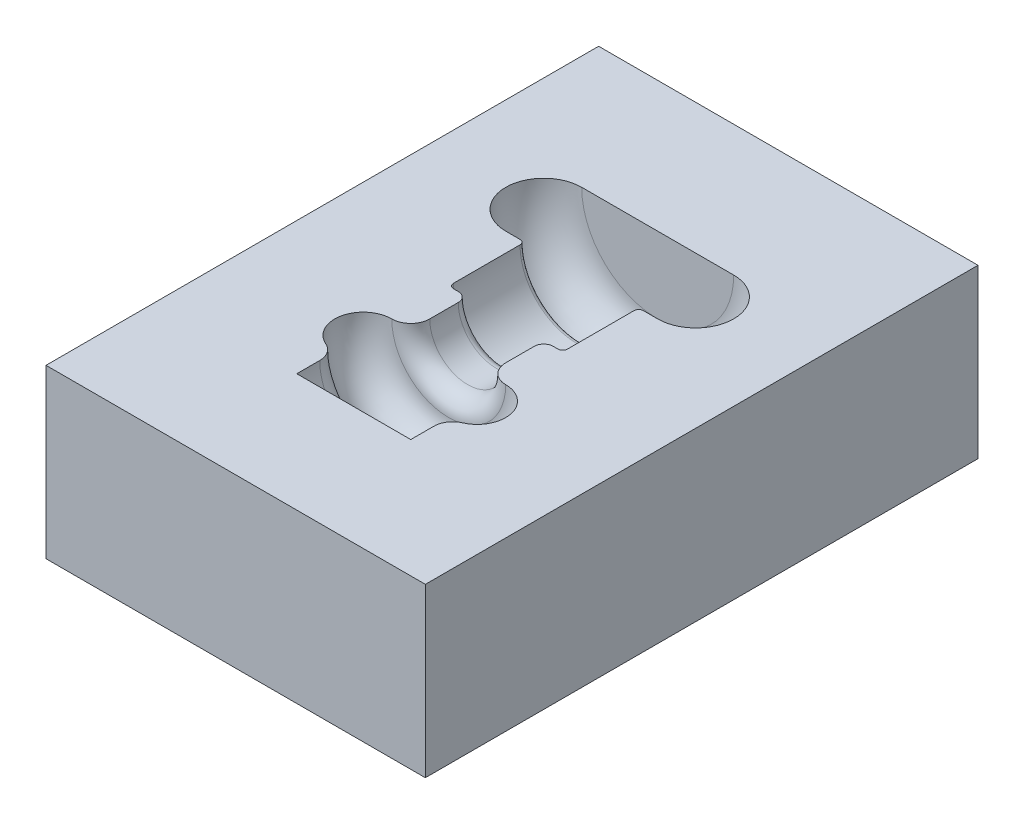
ISO-10303-21;
HEADER;
FILE_DESCRIPTION(('STEP AP214'),'2;1');
FILE_NAME('part.step','',(''),(''),'','','');
FILE_SCHEMA(('AUTOMOTIVE_DESIGN { 1 0 10303 214 1 1 1 1 }'));
ENDSEC;
DATA;
#1=APPLICATION_CONTEXT('core data for automotive mechanical design processes');
#2=APPLICATION_PROTOCOL_DEFINITION('international standard','automotive_design',2000,#1);
#3=PRODUCT_CONTEXT('',#1,'mechanical');
#4=PRODUCT('Part','Part','',(#3));
#5=PRODUCT_RELATED_PRODUCT_CATEGORY('part','',(#4));
#6=PRODUCT_DEFINITION_FORMATION('','',#4);
#7=PRODUCT_DEFINITION_CONTEXT('part definition',#1,'design');
#8=PRODUCT_DEFINITION('design','',#6,#7);
#9=PRODUCT_DEFINITION_SHAPE('','',#8);
#10=(LENGTH_UNIT() NAMED_UNIT(*) SI_UNIT(.MILLI.,.METRE.));
#11=(NAMED_UNIT(*) PLANE_ANGLE_UNIT() SI_UNIT($,.RADIAN.));
#12=(NAMED_UNIT(*) SI_UNIT($,.STERADIAN.) SOLID_ANGLE_UNIT());
#13=UNCERTAINTY_MEASURE_WITH_UNIT(LENGTH_MEASURE(1.E-05),#10,'distance_accuracy_value','');
#14=(GEOMETRIC_REPRESENTATION_CONTEXT(3) GLOBAL_UNCERTAINTY_ASSIGNED_CONTEXT((#13)) GLOBAL_UNIT_ASSIGNED_CONTEXT((#10,
#11,#12)) REPRESENTATION_CONTEXT('',''));
#15=CARTESIAN_POINT('',(0.,0.,0.));
#16=DIRECTION('',(0.,0.,1.));
#17=DIRECTION('',(1.,0.,0.));
#18=AXIS2_PLACEMENT_3D('',#15,#16,#17);
#19=CARTESIAN_POINT('',(-102.966766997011,0.,-153.41));
#20=DIRECTION('',(0.,-1.,0.));
#21=DIRECTION('',(1.,0.,0.));
#22=AXIS2_PLACEMENT_3D('',#19,#20,#21);
#23=PLANE('',#22);
#24=DIRECTION('',(0.,0.,1.));
#25=VECTOR('',#24,1.);
#26=CARTESIAN_POINT('',(-30.9366,0.,82.4976));
#27=LINE('',#26,#25);
#28=CARTESIAN_POINT('',(-30.9366,0.,70.0331185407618));
#29=VERTEX_POINT('',#28);
#30=CARTESIAN_POINT('',(-30.9366,0.,82.4976));
#31=VERTEX_POINT('',#30);
#32=EDGE_CURVE('E237',#29,#31,#27,.T.);
#33=ORIENTED_EDGE('',*,*,#32,.F.);
#34=CARTESIAN_POINT('',(-41.2488,0.,70.0331185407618));
#35=DIRECTION('',(0.,-1.,0.));
#36=DIRECTION('',(1.,0.,0.));
#37=AXIS2_PLACEMENT_3D('',#34,#35,#36);
#38=CIRCLE('',#37,10.3122);
#39=CARTESIAN_POINT('',(-37.12392,0.,60.5818311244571));
#40=VERTEX_POINT('',#39);
#41=EDGE_CURVE('E233',#29,#40,#38,.F.);
#42=ORIENTED_EDGE('',*,*,#41,.T.);
#43=CARTESIAN_POINT('',(-30.9366,0.,46.4049));
#44=DIRECTION('',(0.,-1.,0.));
#45=DIRECTION('',(1.,0.,0.));
#46=AXIS2_PLACEMENT_3D('',#43,#44,#45);
#47=CIRCLE('',#46,15.4683);
#48=CARTESIAN_POINT('',(-30.9366,0.,30.9366));
#49=VERTEX_POINT('',#48);
#50=EDGE_CURVE('E227',#49,#40,#47,.F.);
#51=ORIENTED_EDGE('',*,*,#50,.F.);
#52=CARTESIAN_POINT('',(-30.9366,0.,20.6244));
#53=DIRECTION('',(0.,-1.,0.));
#54=DIRECTION('',(1.,0.,0.));
#55=AXIS2_PLACEMENT_3D('',#52,#53,#54);
#56=CIRCLE('',#55,10.3122);
#57=CARTESIAN_POINT('',(-20.6244,0.,20.6244));
#58=VERTEX_POINT('',#57);
#59=EDGE_CURVE('E223',#49,#58,#56,.F.);
#60=ORIENTED_EDGE('',*,*,#59,.T.);
#61=DIRECTION('',(0.,0.,1.));
#62=VECTOR('',#61,1.);
#63=CARTESIAN_POINT('',(-20.6244,0.,82.4976));
#64=LINE('',#63,#62);
#65=CARTESIAN_POINT('',(-20.6244,0.,5.1561));
#66=VERTEX_POINT('',#65);
#67=EDGE_CURVE('E217',#66,#58,#64,.T.);
#68=ORIENTED_EDGE('',*,*,#67,.F.);
#69=CARTESIAN_POINT('',(-25.7805,0.,5.15609999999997));
#70=DIRECTION('',(0.,-1.,0.));
#71=DIRECTION('',(1.,0.,0.));
#72=AXIS2_PLACEMENT_3D('',#69,#70,#71);
#73=CIRCLE('',#72,5.1561);
#74=CARTESIAN_POINT('',(-25.7805,0.,0.));
#75=VERTEX_POINT('',#74);
#76=EDGE_CURVE('E207',#66,#75,#73,.F.);
#77=ORIENTED_EDGE('',*,*,#76,.T.);
#78=DIRECTION('',(1.,0.,0.));
#79=VECTOR('',#78,1.);
#80=CARTESIAN_POINT('',(0.,0.,0.));
#81=LINE('',#80,#79);
#82=CARTESIAN_POINT('',(-28.35855,0.,0.));
#83=VERTEX_POINT('',#82);
#84=EDGE_CURVE('E215',#83,#75,#81,.T.);
#85=ORIENTED_EDGE('',*,*,#84,.F.);
#86=CARTESIAN_POINT('',(-28.35855,0.,-2.57805000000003));
#87=DIRECTION('',(0.,-1.,0.));
#88=DIRECTION('',(1.,0.,0.));
#89=AXIS2_PLACEMENT_3D('',#86,#87,#88);
#90=CIRCLE('',#89,2.57805);
#91=CARTESIAN_POINT('',(-30.9366,0.,-2.57805000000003));
#92=VERTEX_POINT('',#91);
#93=EDGE_CURVE('E210',#92,#83,#90,.F.);
#94=ORIENTED_EDGE('',*,*,#93,.F.);
#95=DIRECTION('',(0.,0.,1.));
#96=VECTOR('',#95,1.);
#97=CARTESIAN_POINT('',(-30.9366,0.,82.4976));
#98=LINE('',#97,#96);
#99=CARTESIAN_POINT('',(-30.9366,0.,-38.67075));
#100=VERTEX_POINT('',#99);
#101=EDGE_CURVE('E204',#100,#92,#98,.T.);
#102=ORIENTED_EDGE('',*,*,#101,.F.);
#103=CARTESIAN_POINT('',(-33.51465,0.,-38.67075));
#104=DIRECTION('',(0.,-1.,0.));
#105=DIRECTION('',(1.,0.,0.));
#106=AXIS2_PLACEMENT_3D('',#103,#104,#105);
#107=CIRCLE('',#106,2.57805);
#108=CARTESIAN_POINT('',(-33.51465,0.,-41.2488));
#109=VERTEX_POINT('',#108);
#110=EDGE_CURVE('E11',#100,#109,#107,.F.);
#111=ORIENTED_EDGE('',*,*,#110,.T.);
#112=DIRECTION('',(1.,0.,0.));
#113=VECTOR('',#112,1.);
#114=CARTESIAN_POINT('',(0.,0.,-41.2488));
#115=LINE('',#114,#113);
#116=CARTESIAN_POINT('',(-41.2488,0.,-41.2488));
#117=VERTEX_POINT('',#116);
#118=EDGE_CURVE('E203',#117,#109,#115,.T.);
#119=ORIENTED_EDGE('',*,*,#118,.F.);
#120=CARTESIAN_POINT('',(-41.2488,0.,-61.8732));
#121=DIRECTION('',(0.,-1.,0.));
#122=DIRECTION('',(1.,0.,0.));
#123=AXIS2_PLACEMENT_3D('',#120,#121,#122);
#124=CIRCLE('',#123,20.6244);
#125=CARTESIAN_POINT('',(-41.2488,0.,-82.4976));
#126=VERTEX_POINT('',#125);
#127=EDGE_CURVE('E192',#126,#117,#124,.F.);
#128=ORIENTED_EDGE('',*,*,#127,.F.);
#129=DIRECTION('',(-1.,0.,0.));
#130=VECTOR('',#129,1.);
#131=CARTESIAN_POINT('',(0.,0.,-82.4976));
#132=LINE('',#131,#130);
#133=CARTESIAN_POINT('',(41.2488,0.,-82.4976));
#134=VERTEX_POINT('',#133);
#135=EDGE_CURVE('E174',#134,#126,#132,.T.);
#136=ORIENTED_EDGE('',*,*,#135,.F.);
#137=CARTESIAN_POINT('',(41.2488,0.,-61.8732));
#138=DIRECTION('',(0.,-1.,0.));
#139=DIRECTION('',(1.,0.,0.));
#140=AXIS2_PLACEMENT_3D('',#137,#138,#139);
#141=CIRCLE('',#140,20.6244);
#142=CARTESIAN_POINT('',(41.2488,0.,-41.2488));
#143=VERTEX_POINT('',#142);
#144=EDGE_CURVE('E200',#143,#134,#141,.F.);
#145=ORIENTED_EDGE('',*,*,#144,.F.);
#146=CARTESIAN_POINT('',(33.51465,0.,-41.2488));
#147=VERTEX_POINT('',#146);
#148=EDGE_CURVE('E202',#147,#143,#115,.T.);
#149=ORIENTED_EDGE('',*,*,#148,.F.);
#150=CARTESIAN_POINT('',(33.51465,0.,-38.67075));
#151=DIRECTION('',(0.,-1.,0.));
#152=DIRECTION('',(1.,0.,0.));
#153=AXIS2_PLACEMENT_3D('',#150,#151,#152);
#154=CIRCLE('',#153,2.57805);
#155=CARTESIAN_POINT('',(30.9366,0.,-38.67075));
#156=VERTEX_POINT('',#155);
#157=EDGE_CURVE('E40',#147,#156,#154,.F.);
#158=ORIENTED_EDGE('',*,*,#157,.T.);
#159=DIRECTION('',(0.,0.,1.));
#160=VECTOR('',#159,1.);
#161=CARTESIAN_POINT('',(30.9366,0.,82.4976));
#162=LINE('',#161,#160);
#163=CARTESIAN_POINT('',(30.9366,0.,-2.57805000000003));
#164=VERTEX_POINT('',#163);
#165=EDGE_CURVE('E48',#164,#156,#162,.F.);
#166=ORIENTED_EDGE('',*,*,#165,.F.);
#167=CARTESIAN_POINT('',(28.35855,0.,-2.57805000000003));
#168=DIRECTION('',(0.,-1.,0.));
#169=DIRECTION('',(1.,0.,0.));
#170=AXIS2_PLACEMENT_3D('',#167,#168,#169);
#171=CIRCLE('',#170,2.57805);
#172=CARTESIAN_POINT('',(28.35855,0.,0.));
#173=VERTEX_POINT('',#172);
#174=EDGE_CURVE('E212',#173,#164,#171,.F.);
#175=ORIENTED_EDGE('',*,*,#174,.F.);
#176=CARTESIAN_POINT('',(25.7805,0.,0.));
#177=VERTEX_POINT('',#176);
#178=EDGE_CURVE('E214',#177,#173,#81,.T.);
#179=ORIENTED_EDGE('',*,*,#178,.F.);
#180=CARTESIAN_POINT('',(25.7805,0.,5.15609999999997));
#181=DIRECTION('',(0.,-1.,0.));
#182=DIRECTION('',(1.,0.,0.));
#183=AXIS2_PLACEMENT_3D('',#180,#181,#182);
#184=CIRCLE('',#183,5.1561);
#185=CARTESIAN_POINT('',(20.6244,0.,5.1561));
#186=VERTEX_POINT('',#185);
#187=EDGE_CURVE('E220',#177,#186,#184,.F.);
#188=ORIENTED_EDGE('',*,*,#187,.T.);
#189=DIRECTION('',(0.,0.,1.));
#190=VECTOR('',#189,1.);
#191=CARTESIAN_POINT('',(20.6244,0.,82.4976));
#192=LINE('',#191,#190);
#193=CARTESIAN_POINT('',(20.6244,0.,20.6244));
#194=VERTEX_POINT('',#193);
#195=EDGE_CURVE('E225',#194,#186,#192,.F.);
#196=ORIENTED_EDGE('',*,*,#195,.F.);
#197=CARTESIAN_POINT('',(30.9366,0.,20.6244));
#198=DIRECTION('',(0.,-1.,0.));
#199=DIRECTION('',(1.,0.,0.));
#200=AXIS2_PLACEMENT_3D('',#197,#198,#199);
#201=CIRCLE('',#200,10.3122);
#202=CARTESIAN_POINT('',(30.9366,0.,30.9366));
#203=VERTEX_POINT('',#202);
#204=EDGE_CURVE('E230',#194,#203,#201,.F.);
#205=ORIENTED_EDGE('',*,*,#204,.T.);
#206=CARTESIAN_POINT('',(30.9366,0.,46.4049));
#207=DIRECTION('',(0.,-1.,0.));
#208=DIRECTION('',(1.,0.,0.));
#209=AXIS2_PLACEMENT_3D('',#206,#207,#208);
#210=CIRCLE('',#209,15.4683);
#211=CARTESIAN_POINT('',(37.12392,0.,60.5818311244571));
#212=VERTEX_POINT('',#211);
#213=EDGE_CURVE('E235',#212,#203,#210,.F.);
#214=ORIENTED_EDGE('',*,*,#213,.F.);
#215=CARTESIAN_POINT('',(41.2488,0.,70.0331185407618));
#216=DIRECTION('',(0.,-1.,0.));
#217=DIRECTION('',(1.,0.,0.));
#218=AXIS2_PLACEMENT_3D('',#215,#216,#217);
#219=CIRCLE('',#218,10.3122);
#220=CARTESIAN_POINT('',(30.9366,0.,70.0331185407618));
#221=VERTEX_POINT('',#220);
#222=EDGE_CURVE('E194',#212,#221,#219,.F.);
#223=ORIENTED_EDGE('',*,*,#222,.T.);
#224=DIRECTION('',(0.,0.,1.));
#225=VECTOR('',#224,1.);
#226=CARTESIAN_POINT('',(30.9366,0.,82.4976));
#227=LINE('',#226,#225);
#228=CARTESIAN_POINT('',(30.9366,0.,82.4976));
#229=VERTEX_POINT('',#228);
#230=EDGE_CURVE('E244',#229,#221,#227,.F.);
#231=ORIENTED_EDGE('',*,*,#230,.F.);
#232=DIRECTION('',(1.,0.,0.));
#233=VECTOR('',#232,1.);
#234=CARTESIAN_POINT('',(0.,0.,82.4976));
#235=LINE('',#234,#233);
#236=EDGE_CURVE('E245',#31,#229,#235,.T.);
#237=ORIENTED_EDGE('',*,*,#236,.F.);
#238=EDGE_LOOP('',(#33,#42,#51,#60,#68,#77,#85,#94,#102,#111,#119,#128,#136,#145,#149,#158,#166,
#175,#179,#188,#196,#205,#214,#223,#231,#237));
#239=FACE_BOUND('',#238,.T.);
#240=DIRECTION('',(0.,0.,-1.));
#241=VECTOR('',#240,1.);
#242=CARTESIAN_POINT('',(-102.966766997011,0.,146.6));
#243=LINE('',#242,#241);
#244=CARTESIAN_POINT('',(-102.966766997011,0.,146.6));
#245=VERTEX_POINT('',#244);
#246=CARTESIAN_POINT('',(-102.966766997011,0.,-153.4));
#247=VERTEX_POINT('',#246);
#248=EDGE_CURVE('E196',#245,#247,#243,.T.);
#249=ORIENTED_EDGE('',*,*,#248,.F.);
#250=DIRECTION('',(1.,0.,0.));
#251=VECTOR('',#250,1.);
#252=CARTESIAN_POINT('',(0.,0.,146.6));
#253=LINE('',#252,#251);
#254=CARTESIAN_POINT('',(102.966766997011,0.,146.6));
#255=VERTEX_POINT('',#254);
#256=EDGE_CURVE('E161',#245,#255,#253,.T.);
#257=ORIENTED_EDGE('',*,*,#256,.T.);
#258=DIRECTION('',(0.,0.,1.));
#259=VECTOR('',#258,1.);
#260=CARTESIAN_POINT('',(102.966766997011,0.,146.6));
#261=LINE('',#260,#259);
#262=CARTESIAN_POINT('',(102.966766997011,0.,-153.4));
#263=VERTEX_POINT('',#262);
#264=EDGE_CURVE('E195',#263,#255,#261,.T.);
#265=ORIENTED_EDGE('',*,*,#264,.F.);
#266=DIRECTION('',(1.,0.,0.));
#267=VECTOR('',#266,1.);
#268=CARTESIAN_POINT('',(0.,0.,-153.4));
#269=LINE('',#268,#267);
#270=EDGE_CURVE('E35',#247,#263,#269,.T.);
#271=ORIENTED_EDGE('',*,*,#270,.F.);
#272=EDGE_LOOP('',(#249,#257,#265,#271));
#273=FACE_BOUND('',#272,.T.);
#274=ADVANCED_FACE('F32',(#239,#273),#23,.F.);
#275=CARTESIAN_POINT('',(0.,0.,82.4976));
#276=DIRECTION('',(0.,0.,1.));
#277=DIRECTION('',(1.,0.,0.));
#278=AXIS2_PLACEMENT_3D('',#275,#276,#277);
#279=PLANE('',#278);
#280=CARTESIAN_POINT('',(0.,0.,82.4976));
#281=DIRECTION('',(0.,0.,1.));
#282=DIRECTION('',(1.,0.,0.));
#283=AXIS2_PLACEMENT_3D('',#280,#281,#282);
#284=CIRCLE('',#283,30.9366);
#285=EDGE_CURVE('E187',#31,#229,#284,.T.);
#286=ORIENTED_EDGE('',*,*,#285,.F.);
#287=ORIENTED_EDGE('',*,*,#236,.T.);
#288=EDGE_LOOP('',(#286,#287));
#289=FACE_BOUND('',#288,.T.);
#290=ADVANCED_FACE('F341',(#289),#279,.F.);
#291=CARTESIAN_POINT('',(0.,0.,82.4976));
#292=DIRECTION('',(0.,0.,1.));
#293=DIRECTION('',(1.,0.,0.));
#294=AXIS2_PLACEMENT_3D('',#291,#292,#293);
#295=CYLINDRICAL_SURFACE('',#294,30.9366);
#296=ORIENTED_EDGE('',*,*,#285,.T.);
#297=ORIENTED_EDGE('',*,*,#230,.T.);
#298=CARTESIAN_POINT('',(0.,0.,70.0331185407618));
#299=DIRECTION('',(0.,0.,1.));
#300=DIRECTION('',(1.,0.,0.));
#301=AXIS2_PLACEMENT_3D('',#298,#299,#300);
#302=CIRCLE('',#301,30.9366);
#303=EDGE_CURVE('E259',#29,#221,#302,.T.);
#304=ORIENTED_EDGE('',*,*,#303,.F.);
#305=ORIENTED_EDGE('',*,*,#32,.T.);
#306=EDGE_LOOP('',(#296,#297,#304,#305));
#307=FACE_BOUND('',#306,.T.);
#308=ADVANCED_FACE('F340',(#307),#295,.F.);
#309=CARTESIAN_POINT('',(0.,0.,70.0331185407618));
#310=DIRECTION('',(0.,0.,1.));
#311=DIRECTION('',(1.,0.,0.));
#312=AXIS2_PLACEMENT_3D('',#309,#310,#311);
#313=TOROIDAL_SURFACE('',#312,41.2488,10.3122);
#314=ORIENTED_EDGE('',*,*,#222,.F.);
#315=CARTESIAN_POINT('',(0.,0.,60.5818311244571));
#316=DIRECTION('',(0.,0.,1.));
#317=DIRECTION('',(1.,0.,0.));
#318=AXIS2_PLACEMENT_3D('',#315,#316,#317);
#319=CIRCLE('',#318,37.12392);
#320=EDGE_CURVE('E262',#40,#212,#319,.T.);
#321=ORIENTED_EDGE('',*,*,#320,.F.);
#322=ORIENTED_EDGE('',*,*,#41,.F.);
#323=ORIENTED_EDGE('',*,*,#303,.T.);
#324=EDGE_LOOP('',(#314,#321,#322,#323));
#325=FACE_BOUND('',#324,.T.);
#326=ADVANCED_FACE('F337',(#325),#313,.T.);
#327=CARTESIAN_POINT('',(0.,0.,46.4049));
#328=DIRECTION('',(0.,0.,1.));
#329=DIRECTION('',(1.,0.,0.));
#330=AXIS2_PLACEMENT_3D('',#327,#328,#329);
#331=TOROIDAL_SURFACE('',#330,30.9366,15.4683);
#332=ORIENTED_EDGE('',*,*,#320,.T.);
#333=ORIENTED_EDGE('',*,*,#213,.T.);
#334=CARTESIAN_POINT('',(0.,0.,30.9366));
#335=DIRECTION('',(0.,0.,1.));
#336=DIRECTION('',(1.,0.,0.));
#337=AXIS2_PLACEMENT_3D('',#334,#335,#336);
#338=CIRCLE('',#337,30.9366);
#339=EDGE_CURVE('E265',#49,#203,#338,.T.);
#340=ORIENTED_EDGE('',*,*,#339,.F.);
#341=ORIENTED_EDGE('',*,*,#50,.T.);
#342=EDGE_LOOP('',(#332,#333,#340,#341));
#343=FACE_BOUND('',#342,.T.);
#344=ADVANCED_FACE('F334',(#343),#331,.F.);
#345=CARTESIAN_POINT('',(0.,0.,20.6244));
#346=DIRECTION('',(0.,0.,1.));
#347=DIRECTION('',(1.,0.,0.));
#348=AXIS2_PLACEMENT_3D('',#345,#346,#347);
#349=TOROIDAL_SURFACE('',#348,30.9366,10.3122);
#350=ORIENTED_EDGE('',*,*,#204,.F.);
#351=CARTESIAN_POINT('',(0.,0.,20.6244));
#352=DIRECTION('',(0.,0.,1.));
#353=DIRECTION('',(1.,0.,0.));
#354=AXIS2_PLACEMENT_3D('',#351,#352,#353);
#355=CIRCLE('',#354,20.6244);
#356=EDGE_CURVE('E268',#58,#194,#355,.T.);
#357=ORIENTED_EDGE('',*,*,#356,.F.);
#358=ORIENTED_EDGE('',*,*,#59,.F.);
#359=ORIENTED_EDGE('',*,*,#339,.T.);
#360=EDGE_LOOP('',(#350,#357,#358,#359));
#361=FACE_BOUND('',#360,.T.);
#362=ADVANCED_FACE('F331',(#361),#349,.T.);
#363=CARTESIAN_POINT('',(0.,0.,82.4976));
#364=DIRECTION('',(0.,0.,1.));
#365=DIRECTION('',(1.,0.,0.));
#366=AXIS2_PLACEMENT_3D('',#363,#364,#365);
#367=CYLINDRICAL_SURFACE('',#366,20.6244);
#368=ORIENTED_EDGE('',*,*,#356,.T.);
#369=ORIENTED_EDGE('',*,*,#195,.T.);
#370=CARTESIAN_POINT('',(0.,0.,5.1561));
#371=DIRECTION('',(0.,0.,1.));
#372=DIRECTION('',(1.,0.,0.));
#373=AXIS2_PLACEMENT_3D('',#370,#371,#372);
#374=CIRCLE('',#373,20.6244);
#375=EDGE_CURVE('E271',#66,#186,#374,.T.);
#376=ORIENTED_EDGE('',*,*,#375,.F.);
#377=ORIENTED_EDGE('',*,*,#67,.T.);
#378=EDGE_LOOP('',(#368,#369,#376,#377));
#379=FACE_BOUND('',#378,.T.);
#380=ADVANCED_FACE('F326',(#379),#367,.F.);
#381=CARTESIAN_POINT('',(0.,0.,5.15609999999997));
#382=DIRECTION('',(0.,0.,1.));
#383=DIRECTION('',(1.,0.,0.));
#384=AXIS2_PLACEMENT_3D('',#381,#382,#383);
#385=TOROIDAL_SURFACE('',#384,25.7805,5.1561);
#386=ORIENTED_EDGE('',*,*,#187,.F.);
#387=CARTESIAN_POINT('',(0.,0.,0.));
#388=DIRECTION('',(0.,0.,1.));
#389=DIRECTION('',(1.,0.,0.));
#390=AXIS2_PLACEMENT_3D('',#387,#388,#389);
#391=CIRCLE('',#390,25.7805);
#392=EDGE_CURVE('E274',#75,#177,#391,.T.);
#393=ORIENTED_EDGE('',*,*,#392,.F.);
#394=ORIENTED_EDGE('',*,*,#76,.F.);
#395=ORIENTED_EDGE('',*,*,#375,.T.);
#396=EDGE_LOOP('',(#386,#393,#394,#395));
#397=FACE_BOUND('',#396,.T.);
#398=ADVANCED_FACE('F322',(#397),#385,.T.);
#399=CARTESIAN_POINT('',(0.,0.,0.));
#400=DIRECTION('',(0.,0.,1.));
#401=DIRECTION('',(1.,0.,0.));
#402=AXIS2_PLACEMENT_3D('',#399,#400,#401);
#403=PLANE('',#402);
#404=CARTESIAN_POINT('',(0.,0.,0.));
#405=DIRECTION('',(0.,0.,1.));
#406=DIRECTION('',(1.,0.,0.));
#407=AXIS2_PLACEMENT_3D('',#404,#405,#406);
#408=CIRCLE('',#407,28.35855);
#409=EDGE_CURVE('E277',#83,#173,#408,.T.);
#410=ORIENTED_EDGE('',*,*,#409,.F.);
#411=ORIENTED_EDGE('',*,*,#84,.T.);
#412=ORIENTED_EDGE('',*,*,#392,.T.);
#413=ORIENTED_EDGE('',*,*,#178,.T.);
#414=EDGE_LOOP('',(#410,#411,#412,#413));
#415=FACE_BOUND('',#414,.T.);
#416=ADVANCED_FACE('F320',(#415),#403,.F.);
#417=CARTESIAN_POINT('',(0.,0.,-2.57805000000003));
#418=DIRECTION('',(0.,0.,1.));
#419=DIRECTION('',(1.,0.,0.));
#420=AXIS2_PLACEMENT_3D('',#417,#418,#419);
#421=TOROIDAL_SURFACE('',#420,28.35855,2.57805);
#422=ORIENTED_EDGE('',*,*,#409,.T.);
#423=ORIENTED_EDGE('',*,*,#174,.T.);
#424=CARTESIAN_POINT('',(0.,0.,-2.57805000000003));
#425=DIRECTION('',(0.,0.,1.));
#426=DIRECTION('',(1.,0.,0.));
#427=AXIS2_PLACEMENT_3D('',#424,#425,#426);
#428=CIRCLE('',#427,30.9366);
#429=EDGE_CURVE('E280',#92,#164,#428,.T.);
#430=ORIENTED_EDGE('',*,*,#429,.F.);
#431=ORIENTED_EDGE('',*,*,#93,.T.);
#432=EDGE_LOOP('',(#422,#423,#430,#431));
#433=FACE_BOUND('',#432,.T.);
#434=ADVANCED_FACE('F315',(#433),#421,.F.);
#435=CARTESIAN_POINT('',(0.,0.,82.4976));
#436=DIRECTION('',(0.,0.,1.));
#437=DIRECTION('',(1.,0.,0.));
#438=AXIS2_PLACEMENT_3D('',#435,#436,#437);
#439=CYLINDRICAL_SURFACE('',#438,30.9366);
#440=ORIENTED_EDGE('',*,*,#429,.T.);
#441=ORIENTED_EDGE('',*,*,#165,.T.);
#442=CARTESIAN_POINT('',(0.,0.,-38.67075));
#443=DIRECTION('',(0.,0.,1.));
#444=DIRECTION('',(1.,0.,0.));
#445=AXIS2_PLACEMENT_3D('',#442,#443,#444);
#446=CIRCLE('',#445,30.9366);
#447=EDGE_CURVE('E282',#100,#156,#446,.T.);
#448=ORIENTED_EDGE('',*,*,#447,.F.);
#449=ORIENTED_EDGE('',*,*,#101,.T.);
#450=EDGE_LOOP('',(#440,#441,#448,#449));
#451=FACE_BOUND('',#450,.T.);
#452=ADVANCED_FACE('F309',(#451),#439,.F.);
#453=CARTESIAN_POINT('',(0.,0.,-38.67075));
#454=DIRECTION('',(0.,0.,1.));
#455=DIRECTION('',(1.,0.,0.));
#456=AXIS2_PLACEMENT_3D('',#453,#454,#455);
#457=TOROIDAL_SURFACE('',#456,33.51465,2.57805);
#458=ORIENTED_EDGE('',*,*,#157,.F.);
#459=CARTESIAN_POINT('',(0.,0.,-41.2488));
#460=DIRECTION('',(0.,0.,1.));
#461=DIRECTION('',(1.,0.,0.));
#462=AXIS2_PLACEMENT_3D('',#459,#460,#461);
#463=CIRCLE('',#462,33.51465);
#464=EDGE_CURVE('E284',#109,#147,#463,.T.);
#465=ORIENTED_EDGE('',*,*,#464,.F.);
#466=ORIENTED_EDGE('',*,*,#110,.F.);
#467=ORIENTED_EDGE('',*,*,#447,.T.);
#468=EDGE_LOOP('',(#458,#465,#466,#467));
#469=FACE_BOUND('',#468,.T.);
#470=ADVANCED_FACE('F308',(#469),#457,.T.);
#471=CARTESIAN_POINT('',(0.,0.,-41.2488));
#472=DIRECTION('',(0.,0.,1.));
#473=DIRECTION('',(1.,0.,0.));
#474=AXIS2_PLACEMENT_3D('',#471,#472,#473);
#475=PLANE('',#474);
#476=CARTESIAN_POINT('',(0.,0.,-41.2488));
#477=DIRECTION('',(0.,0.,1.));
#478=DIRECTION('',(1.,0.,0.));
#479=AXIS2_PLACEMENT_3D('',#476,#477,#478);
#480=CIRCLE('',#479,41.2488);
#481=EDGE_CURVE('E287',#117,#143,#480,.T.);
#482=ORIENTED_EDGE('',*,*,#481,.F.);
#483=ORIENTED_EDGE('',*,*,#118,.T.);
#484=ORIENTED_EDGE('',*,*,#464,.T.);
#485=ORIENTED_EDGE('',*,*,#148,.T.);
#486=EDGE_LOOP('',(#482,#483,#484,#485));
#487=FACE_BOUND('',#486,.T.);
#488=ADVANCED_FACE('F306',(#487),#475,.F.);
#489=CARTESIAN_POINT('',(0.,0.,-61.8732));
#490=DIRECTION('',(0.,0.,1.));
#491=DIRECTION('',(1.,0.,0.));
#492=AXIS2_PLACEMENT_3D('',#489,#490,#491);
#493=TOROIDAL_SURFACE('',#492,41.2488,20.6244);
#494=ORIENTED_EDGE('',*,*,#481,.T.);
#495=ORIENTED_EDGE('',*,*,#144,.T.);
#496=CARTESIAN_POINT('',(0.,0.,-82.4976));
#497=DIRECTION('',(0.,0.,1.));
#498=DIRECTION('',(1.,0.,0.));
#499=AXIS2_PLACEMENT_3D('',#496,#497,#498);
#500=CIRCLE('',#499,41.2488);
#501=EDGE_CURVE('E290',#126,#134,#500,.T.);
#502=ORIENTED_EDGE('',*,*,#501,.F.);
#503=ORIENTED_EDGE('',*,*,#127,.T.);
#504=EDGE_LOOP('',(#494,#495,#502,#503));
#505=FACE_BOUND('',#504,.T.);
#506=ADVANCED_FACE('F298',(#505),#493,.F.);
#507=CARTESIAN_POINT('',(0.,0.,-82.4976));
#508=DIRECTION('',(0.,0.,-1.));
#509=DIRECTION('',(-1.,0.,0.));
#510=AXIS2_PLACEMENT_3D('',#507,#508,#509);
#511=PLANE('',#510);
#512=ORIENTED_EDGE('',*,*,#501,.T.);
#513=ORIENTED_EDGE('',*,*,#135,.T.);
#514=EDGE_LOOP('',(#512,#513));
#515=FACE_BOUND('',#514,.T.);
#516=ADVANCED_FACE('F294',(#515),#511,.F.);
#517=CARTESIAN_POINT('',(-102.966766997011,-90.934066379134,146.6));
#518=DIRECTION('',(0.,1.,0.));
#519=DIRECTION('',(-1.,0.,0.));
#520=AXIS2_PLACEMENT_3D('',#517,#518,#519);
#521=PLANE('',#520);
#522=DIRECTION('',(1.,0.,0.));
#523=VECTOR('',#522,1.);
#524=CARTESIAN_POINT('',(-102.966766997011,-90.934066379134,-153.4));
#525=LINE('',#524,#523);
#526=CARTESIAN_POINT('',(-102.966766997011,-90.934066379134,-153.4));
#527=VERTEX_POINT('',#526);
#528=CARTESIAN_POINT('',(102.966766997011,-90.934066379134,-153.4));
#529=VERTEX_POINT('',#528);
#530=EDGE_CURVE('E189',#527,#529,#525,.T.);
#531=ORIENTED_EDGE('',*,*,#530,.T.);
#532=DIRECTION('',(0.,0.,-1.));
#533=VECTOR('',#532,1.);
#534=CARTESIAN_POINT('',(102.966766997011,-90.934066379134,146.6));
#535=LINE('',#534,#533);
#536=CARTESIAN_POINT('',(102.966766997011,-90.934066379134,146.6));
#537=VERTEX_POINT('',#536);
#538=EDGE_CURVE('E175',#537,#529,#535,.T.);
#539=ORIENTED_EDGE('',*,*,#538,.F.);
#540=DIRECTION('',(1.,0.,0.));
#541=VECTOR('',#540,1.);
#542=CARTESIAN_POINT('',(-102.966766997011,-90.934066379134,146.6));
#543=LINE('',#542,#541);
#544=CARTESIAN_POINT('',(-102.966766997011,-90.934066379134,146.6));
#545=VERTEX_POINT('',#544);
#546=EDGE_CURVE('E158',#545,#537,#543,.T.);
#547=ORIENTED_EDGE('',*,*,#546,.F.);
#548=DIRECTION('',(0.,0.,-1.));
#549=VECTOR('',#548,1.);
#550=CARTESIAN_POINT('',(-102.966766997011,-90.934066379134,146.6));
#551=LINE('',#550,#549);
#552=EDGE_CURVE('E168',#545,#527,#551,.T.);
#553=ORIENTED_EDGE('',*,*,#552,.T.);
#554=EDGE_LOOP('',(#531,#539,#547,#553));
#555=FACE_BOUND('',#554,.T.);
#556=ADVANCED_FACE('F177',(#555),#521,.F.);
#557=CARTESIAN_POINT('',(102.966766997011,90.9340663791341,146.6));
#558=DIRECTION('',(-1.,0.,0.));
#559=DIRECTION('',(0.,0.,1.));
#560=AXIS2_PLACEMENT_3D('',#557,#558,#559);
#561=PLANE('',#560);
#562=DIRECTION('',(0.,1.,0.));
#563=VECTOR('',#562,1.);
#564=CARTESIAN_POINT('',(102.966766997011,90.9340663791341,-153.4));
#565=LINE('',#564,#563);
#566=EDGE_CURVE('E184',#529,#263,#565,.T.);
#567=ORIENTED_EDGE('',*,*,#566,.T.);
#568=ORIENTED_EDGE('',*,*,#264,.T.);
#569=DIRECTION('',(0.,1.,0.));
#570=VECTOR('',#569,1.);
#571=CARTESIAN_POINT('',(102.966766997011,90.9340663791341,146.6));
#572=LINE('',#571,#570);
#573=EDGE_CURVE('E165',#537,#255,#572,.T.);
#574=ORIENTED_EDGE('',*,*,#573,.F.);
#575=ORIENTED_EDGE('',*,*,#538,.T.);
#576=EDGE_LOOP('',(#567,#568,#574,#575));
#577=FACE_BOUND('',#576,.T.);
#578=ADVANCED_FACE('F255',(#577),#561,.F.);
#579=CARTESIAN_POINT('',(-102.966766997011,90.9340663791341,146.6));
#580=DIRECTION('',(1.,0.,0.));
#581=DIRECTION('',(0.,0.,-1.));
#582=AXIS2_PLACEMENT_3D('',#579,#580,#581);
#583=PLANE('',#582);
#584=DIRECTION('',(0.,-1.,0.));
#585=VECTOR('',#584,1.);
#586=CARTESIAN_POINT('',(-102.966766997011,90.9340663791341,146.6));
#587=LINE('',#586,#585);
#588=EDGE_CURVE('E153',#245,#545,#587,.T.);
#589=ORIENTED_EDGE('',*,*,#588,.F.);
#590=ORIENTED_EDGE('',*,*,#248,.T.);
#591=DIRECTION('',(0.,-1.,0.));
#592=VECTOR('',#591,1.);
#593=CARTESIAN_POINT('',(-102.966766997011,90.9340663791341,-153.4));
#594=LINE('',#593,#592);
#595=EDGE_CURVE('E171',#247,#527,#594,.T.);
#596=ORIENTED_EDGE('',*,*,#595,.T.);
#597=ORIENTED_EDGE('',*,*,#552,.F.);
#598=EDGE_LOOP('',(#589,#590,#596,#597));
#599=FACE_BOUND('',#598,.T.);
#600=ADVANCED_FACE('F169',(#599),#583,.F.);
#601=CARTESIAN_POINT('',(0.,0.,-153.4));
#602=DIRECTION('',(0.,0.,1.));
#603=DIRECTION('',(1.,0.,0.));
#604=AXIS2_PLACEMENT_3D('',#601,#602,#603);
#605=PLANE('',#604);
#606=ORIENTED_EDGE('',*,*,#595,.F.);
#607=ORIENTED_EDGE('',*,*,#270,.T.);
#608=ORIENTED_EDGE('',*,*,#566,.F.);
#609=ORIENTED_EDGE('',*,*,#530,.F.);
#610=EDGE_LOOP('',(#606,#607,#608,#609));
#611=FACE_BOUND('',#610,.T.);
#612=ADVANCED_FACE('F252',(#611),#605,.F.);
#613=CARTESIAN_POINT('',(0.,0.,146.6));
#614=DIRECTION('',(0.,0.,1.));
#615=DIRECTION('',(1.,0.,0.));
#616=AXIS2_PLACEMENT_3D('',#613,#614,#615);
#617=PLANE('',#616);
#618=ORIENTED_EDGE('',*,*,#256,.F.);
#619=ORIENTED_EDGE('',*,*,#588,.T.);
#620=ORIENTED_EDGE('',*,*,#546,.T.);
#621=ORIENTED_EDGE('',*,*,#573,.T.);
#622=EDGE_LOOP('',(#618,#619,#620,#621));
#623=FACE_BOUND('',#622,.T.);
#624=ADVANCED_FACE('F155',(#623),#617,.T.);
#625=CLOSED_SHELL('',(#274,#290,#308,#326,#344,#362,#380,#398,#416,#434,#452,#470,#488,#506,
#516,#556,#578,#600,#612,#624));
#626=MANIFOLD_SOLID_BREP('B2',#625);
#627=ADVANCED_BREP_SHAPE_REPRESENTATION('',(#18,#626),#14);
#628=SHAPE_DEFINITION_REPRESENTATION(#9,#627);
ENDSEC;
END-ISO-10303-21;
